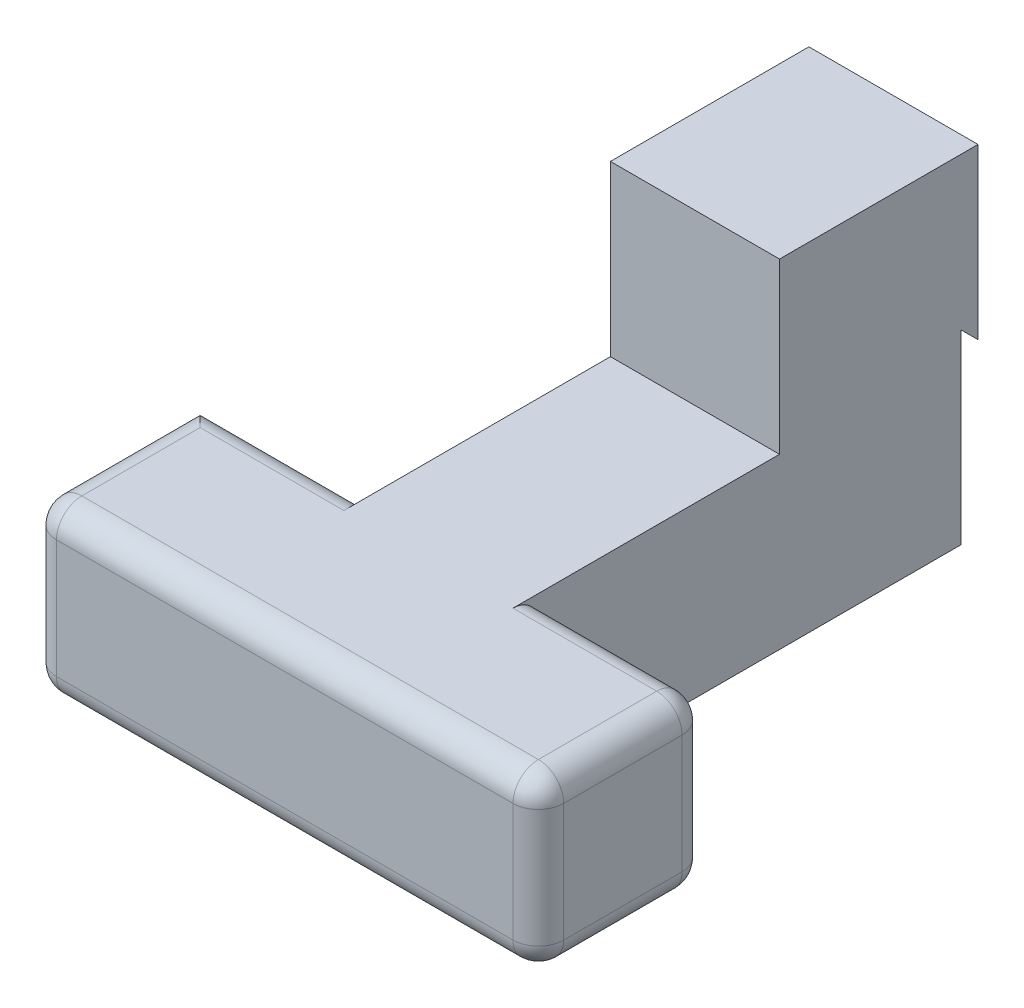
ISO-10303-21;
HEADER;
FILE_DESCRIPTION(('STEP AP214'),'2;1');
FILE_NAME('part.step','',(''),(''),'','','');
FILE_SCHEMA(('AUTOMOTIVE_DESIGN { 1 0 10303 214 1 1 1 1 }'));
ENDSEC;
DATA;
#1=APPLICATION_CONTEXT('core data for automotive mechanical design processes');
#2=APPLICATION_PROTOCOL_DEFINITION('international standard','automotive_design',2000,#1);
#3=PRODUCT_CONTEXT('',#1,'mechanical');
#4=PRODUCT('Part','Part','',(#3));
#5=PRODUCT_RELATED_PRODUCT_CATEGORY('part','',(#4));
#6=PRODUCT_DEFINITION_FORMATION('','',#4);
#7=PRODUCT_DEFINITION_CONTEXT('part definition',#1,'design');
#8=PRODUCT_DEFINITION('design','',#6,#7);
#9=PRODUCT_DEFINITION_SHAPE('','',#8);
#10=(LENGTH_UNIT() NAMED_UNIT(*) SI_UNIT(.MILLI.,.METRE.));
#11=(NAMED_UNIT(*) PLANE_ANGLE_UNIT() SI_UNIT($,.RADIAN.));
#12=(NAMED_UNIT(*) SI_UNIT($,.STERADIAN.) SOLID_ANGLE_UNIT());
#13=UNCERTAINTY_MEASURE_WITH_UNIT(LENGTH_MEASURE(1.E-05),#10,'distance_accuracy_value','');
#14=(GEOMETRIC_REPRESENTATION_CONTEXT(3) GLOBAL_UNCERTAINTY_ASSIGNED_CONTEXT((#13)) GLOBAL_UNIT_ASSIGNED_CONTEXT((#10,
#11,#12)) REPRESENTATION_CONTEXT('',''));
#15=CARTESIAN_POINT('',(0.,0.,0.));
#16=DIRECTION('',(0.,0.,1.));
#17=DIRECTION('',(1.,0.,0.));
#18=AXIS2_PLACEMENT_3D('',#15,#16,#17);
#19=CARTESIAN_POINT('',(10.,10.,25.));
#20=DIRECTION('',(-1.,0.,0.));
#21=DIRECTION('',(0.,0.,1.));
#22=AXIS2_PLACEMENT_3D('',#19,#20,#21);
#23=PLANE('',#22);
#24=DIRECTION('',(0.,0.707106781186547,0.707106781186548));
#25=VECTOR('',#24,1.);
#26=CARTESIAN_POINT('',(10.,12.,-25.));
#27=LINE('',#26,#25);
#28=CARTESIAN_POINT('',(10.,10.,-27.));
#29=VERTEX_POINT('',#28);
#30=CARTESIAN_POINT('',(10.,12.,-25.));
#31=VERTEX_POINT('',#30);
#32=EDGE_CURVE('E199',#29,#31,#27,.T.);
#33=ORIENTED_EDGE('',*,*,#32,.F.);
#34=DIRECTION('',(0.,-1.,0.));
#35=VECTOR('',#34,1.);
#36=CARTESIAN_POINT('',(10.,30.,-27.));
#37=LINE('',#36,#35);
#38=CARTESIAN_POINT('',(10.,30.,-27.));
#39=VERTEX_POINT('',#38);
#40=EDGE_CURVE('E234',#39,#29,#37,.T.);
#41=ORIENTED_EDGE('',*,*,#40,.F.);
#42=DIRECTION('',(0.,0.,-1.));
#43=VECTOR('',#42,1.);
#44=CARTESIAN_POINT('',(10.,30.,-3.52397749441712));
#45=LINE('',#44,#43);
#46=CARTESIAN_POINT('',(10.,30.,-3.52397749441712));
#47=VERTEX_POINT('',#46);
#48=EDGE_CURVE('E211',#47,#39,#45,.T.);
#49=ORIENTED_EDGE('',*,*,#48,.F.);
#50=DIRECTION('',(0.,-1.,0.));
#51=VECTOR('',#50,1.);
#52=CARTESIAN_POINT('',(10.,30.,-3.52397749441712));
#53=LINE('',#52,#51);
#54=CARTESIAN_POINT('',(10.,10.,-3.52397749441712));
#55=VERTEX_POINT('',#54);
#56=EDGE_CURVE('E222',#47,#55,#53,.T.);
#57=ORIENTED_EDGE('',*,*,#56,.T.);
#58=DIRECTION('',(0.,0.,-1.));
#59=VECTOR('',#58,1.);
#60=CARTESIAN_POINT('',(10.,10.,25.));
#61=LINE('',#60,#59);
#62=CARTESIAN_POINT('',(10.,10.,28.));
#63=VERTEX_POINT('',#62);
#64=EDGE_CURVE('E191',#63,#55,#61,.T.);
#65=ORIENTED_EDGE('',*,*,#64,.F.);
#66=CARTESIAN_POINT('',(10.,7.,28.));
#67=DIRECTION('',(-1.,0.,0.));
#68=DIRECTION('',(0.,0.,1.));
#69=AXIS2_PLACEMENT_3D('',#66,#67,#68);
#70=CIRCLE('',#69,3.);
#71=CARTESIAN_POINT('',(10.,7.,25.));
#72=VERTEX_POINT('',#71);
#73=EDGE_CURVE('E48',#63,#72,#70,.T.);
#74=ORIENTED_EDGE('',*,*,#73,.T.);
#75=DIRECTION('',(0.,-1.,0.));
#76=VECTOR('',#75,1.);
#77=CARTESIAN_POINT('',(10.,10.,25.));
#78=LINE('',#77,#76);
#79=CARTESIAN_POINT('',(10.,-7.,25.));
#80=VERTEX_POINT('',#79);
#81=EDGE_CURVE('E251',#72,#80,#78,.T.);
#82=ORIENTED_EDGE('',*,*,#81,.T.);
#83=CARTESIAN_POINT('',(10.,-7.,28.));
#84=DIRECTION('',(-1.,0.,0.));
#85=DIRECTION('',(0.,0.,1.));
#86=AXIS2_PLACEMENT_3D('',#83,#84,#85);
#87=CIRCLE('',#86,3.);
#88=CARTESIAN_POINT('',(10.,-10.,28.));
#89=VERTEX_POINT('',#88);
#90=EDGE_CURVE('E316',#80,#89,#87,.T.);
#91=ORIENTED_EDGE('',*,*,#90,.T.);
#92=DIRECTION('',(0.,0.,-1.));
#93=VECTOR('',#92,1.);
#94=CARTESIAN_POINT('',(10.,-10.,25.));
#95=LINE('',#94,#93);
#96=CARTESIAN_POINT('',(10.,-10.,-25.));
#97=VERTEX_POINT('',#96);
#98=EDGE_CURVE('E246',#89,#97,#95,.T.);
#99=ORIENTED_EDGE('',*,*,#98,.T.);
#100=DIRECTION('',(0.,-1.,0.));
#101=VECTOR('',#100,1.);
#102=CARTESIAN_POINT('',(10.,10.,-25.));
#103=LINE('',#102,#101);
#104=EDGE_CURVE('E57',#31,#97,#103,.T.);
#105=ORIENTED_EDGE('',*,*,#104,.F.);
#106=EDGE_LOOP('',(#33,#41,#49,#57,#65,#74,#82,#91,#99,#105));
#107=FACE_BOUND('',#106,.T.);
#108=ADVANCED_FACE('F39',(#107),#23,.F.);
#109=CARTESIAN_POINT('',(-10.,10.,25.));
#110=DIRECTION('',(1.,0.,0.));
#111=DIRECTION('',(0.,0.,-1.));
#112=AXIS2_PLACEMENT_3D('',#109,#110,#111);
#113=PLANE('',#112);
#114=DIRECTION('',(0.,-1.,0.));
#115=VECTOR('',#114,1.);
#116=CARTESIAN_POINT('',(-10.,30.,-27.));
#117=LINE('',#116,#115);
#118=CARTESIAN_POINT('',(-10.,30.,-27.));
#119=VERTEX_POINT('',#118);
#120=CARTESIAN_POINT('',(-10.,10.,-27.));
#121=VERTEX_POINT('',#120);
#122=EDGE_CURVE('E210',#119,#121,#117,.T.);
#123=ORIENTED_EDGE('',*,*,#122,.T.);
#124=DIRECTION('',(0.,0.707106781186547,0.707106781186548));
#125=VECTOR('',#124,1.);
#126=CARTESIAN_POINT('',(-10.,12.,-25.));
#127=LINE('',#126,#125);
#128=CARTESIAN_POINT('',(-10.,12.,-25.));
#129=VERTEX_POINT('',#128);
#130=EDGE_CURVE('E196',#121,#129,#127,.T.);
#131=ORIENTED_EDGE('',*,*,#130,.T.);
#132=DIRECTION('',(0.,-1.,0.));
#133=VECTOR('',#132,1.);
#134=CARTESIAN_POINT('',(-10.,10.,-25.));
#135=LINE('',#134,#133);
#136=CARTESIAN_POINT('',(-10.,-10.,-25.));
#137=VERTEX_POINT('',#136);
#138=EDGE_CURVE('E188',#129,#137,#135,.T.);
#139=ORIENTED_EDGE('',*,*,#138,.T.);
#140=DIRECTION('',(0.,0.,1.));
#141=VECTOR('',#140,1.);
#142=CARTESIAN_POINT('',(-10.,-10.,25.));
#143=LINE('',#142,#141);
#144=CARTESIAN_POINT('',(-10.,-10.,28.));
#145=VERTEX_POINT('',#144);
#146=EDGE_CURVE('E242',#137,#145,#143,.T.);
#147=ORIENTED_EDGE('',*,*,#146,.T.);
#148=CARTESIAN_POINT('',(-10.,-7.,28.));
#149=DIRECTION('',(1.,0.,0.));
#150=DIRECTION('',(0.,0.,-1.));
#151=AXIS2_PLACEMENT_3D('',#148,#149,#150);
#152=CIRCLE('',#151,3.);
#153=CARTESIAN_POINT('',(-10.,-7.,25.));
#154=VERTEX_POINT('',#153);
#155=EDGE_CURVE('E62',#145,#154,#152,.T.);
#156=ORIENTED_EDGE('',*,*,#155,.T.);
#157=DIRECTION('',(0.,-1.,0.));
#158=VECTOR('',#157,1.);
#159=CARTESIAN_POINT('',(-10.,10.,25.));
#160=LINE('',#159,#158);
#161=CARTESIAN_POINT('',(-10.,7.,25.));
#162=VERTEX_POINT('',#161);
#163=EDGE_CURVE('E258',#162,#154,#160,.T.);
#164=ORIENTED_EDGE('',*,*,#163,.F.);
#165=CARTESIAN_POINT('',(-10.,7.,28.));
#166=DIRECTION('',(1.,0.,0.));
#167=DIRECTION('',(0.,0.,-1.));
#168=AXIS2_PLACEMENT_3D('',#165,#166,#167);
#169=CIRCLE('',#168,3.);
#170=CARTESIAN_POINT('',(-10.,10.,28.));
#171=VERTEX_POINT('',#170);
#172=EDGE_CURVE('E11',#162,#171,#169,.T.);
#173=ORIENTED_EDGE('',*,*,#172,.T.);
#174=DIRECTION('',(0.,0.,1.));
#175=VECTOR('',#174,1.);
#176=CARTESIAN_POINT('',(-10.,10.,25.));
#177=LINE('',#176,#175);
#178=CARTESIAN_POINT('',(-10.,10.,-3.52397749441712));
#179=VERTEX_POINT('',#178);
#180=EDGE_CURVE('E244',#179,#171,#177,.T.);
#181=ORIENTED_EDGE('',*,*,#180,.F.);
#182=DIRECTION('',(0.,-1.,0.));
#183=VECTOR('',#182,1.);
#184=CARTESIAN_POINT('',(-10.,30.,-3.52397749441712));
#185=LINE('',#184,#183);
#186=CARTESIAN_POINT('',(-10.,30.,-3.52397749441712));
#187=VERTEX_POINT('',#186);
#188=EDGE_CURVE('E226',#187,#179,#185,.T.);
#189=ORIENTED_EDGE('',*,*,#188,.F.);
#190=DIRECTION('',(0.,0.,1.));
#191=VECTOR('',#190,1.);
#192=CARTESIAN_POINT('',(-10.,30.,-3.52397749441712));
#193=LINE('',#192,#191);
#194=EDGE_CURVE('E220',#119,#187,#193,.T.);
#195=ORIENTED_EDGE('',*,*,#194,.F.);
#196=EDGE_LOOP('',(#123,#131,#139,#147,#156,#164,#173,#181,#189,#195));
#197=FACE_BOUND('',#196,.T.);
#198=ADVANCED_FACE('F204',(#197),#113,.F.);
#199=CARTESIAN_POINT('',(10.,10.,-25.));
#200=DIRECTION('',(0.,0.,1.));
#201=DIRECTION('',(1.,0.,0.));
#202=AXIS2_PLACEMENT_3D('',#199,#200,#201);
#203=PLANE('',#202);
#204=CARTESIAN_POINT('',(0.,0.,-25.));
#205=DIRECTION('',(0.,0.,-1.));
#206=DIRECTION('',(-1.,0.,0.));
#207=AXIS2_PLACEMENT_3D('',#204,#205,#206);
#208=CIRCLE('',#207,5.);
#209=CARTESIAN_POINT('',(-5.,0.,-25.));
#210=VERTEX_POINT('',#209);
#211=EDGE_CURVE('E233',#210,#210,#208,.T.);
#212=ORIENTED_EDGE('',*,*,#211,.F.);
#213=EDGE_LOOP('',(#212));
#214=FACE_BOUND('',#213,.T.);
#215=DIRECTION('',(-1.,0.,0.));
#216=VECTOR('',#215,1.);
#217=CARTESIAN_POINT('',(10.,-10.,-25.));
#218=LINE('',#217,#216);
#219=EDGE_CURVE('E192',#97,#137,#218,.T.);
#220=ORIENTED_EDGE('',*,*,#219,.T.);
#221=ORIENTED_EDGE('',*,*,#138,.F.);
#222=DIRECTION('',(1.,0.,0.));
#223=VECTOR('',#222,1.);
#224=CARTESIAN_POINT('',(-10.,12.,-25.));
#225=LINE('',#224,#223);
#226=EDGE_CURVE('E187',#129,#31,#225,.T.);
#227=ORIENTED_EDGE('',*,*,#226,.T.);
#228=ORIENTED_EDGE('',*,*,#104,.T.);
#229=EDGE_LOOP('',(#220,#221,#227,#228));
#230=FACE_BOUND('',#229,.T.);
#231=ADVANCED_FACE('F186',(#214,#230),#203,.F.);
#232=CARTESIAN_POINT('',(0.,10.,0.));
#233=DIRECTION('',(0.,1.,0.));
#234=DIRECTION('',(0.,0.,1.));
#235=AXIS2_PLACEMENT_3D('',#232,#233,#234);
#236=PLANE('',#235);
#237=DIRECTION('',(-1.,0.,0.));
#238=VECTOR('',#237,1.);
#239=CARTESIAN_POINT('',(10.,10.,28.));
#240=LINE('',#239,#238);
#241=CARTESIAN_POINT('',(27.,10.,28.));
#242=VERTEX_POINT('',#241);
#243=EDGE_CURVE('E270',#242,#63,#240,.T.);
#244=ORIENTED_EDGE('',*,*,#243,.T.);
#245=ORIENTED_EDGE('',*,*,#64,.T.);
#246=DIRECTION('',(1.,0.,0.));
#247=VECTOR('',#246,1.);
#248=CARTESIAN_POINT('',(-10.,10.,-3.52397749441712));
#249=LINE('',#248,#247);
#250=EDGE_CURVE('E214',#179,#55,#249,.T.);
#251=ORIENTED_EDGE('',*,*,#250,.F.);
#252=ORIENTED_EDGE('',*,*,#180,.T.);
#253=DIRECTION('',(-1.,0.,0.));
#254=VECTOR('',#253,1.);
#255=CARTESIAN_POINT('',(-30.,10.,28.));
#256=LINE('',#255,#254);
#257=CARTESIAN_POINT('',(-27.,10.,28.));
#258=VERTEX_POINT('',#257);
#259=EDGE_CURVE('E256',#171,#258,#256,.T.);
#260=ORIENTED_EDGE('',*,*,#259,.T.);
#261=DIRECTION('',(0.,0.,1.));
#262=VECTOR('',#261,1.);
#263=CARTESIAN_POINT('',(-27.,10.,45.));
#264=LINE('',#263,#262);
#265=CARTESIAN_POINT('',(-27.,10.,42.));
#266=VERTEX_POINT('',#265);
#267=EDGE_CURVE('E257',#258,#266,#264,.T.);
#268=ORIENTED_EDGE('',*,*,#267,.T.);
#269=DIRECTION('',(1.,0.,0.));
#270=VECTOR('',#269,1.);
#271=CARTESIAN_POINT('',(30.,10.,42.));
#272=LINE('',#271,#270);
#273=CARTESIAN_POINT('',(27.,10.,42.));
#274=VERTEX_POINT('',#273);
#275=EDGE_CURVE('E263',#266,#274,#272,.T.);
#276=ORIENTED_EDGE('',*,*,#275,.T.);
#277=DIRECTION('',(0.,0.,-1.));
#278=VECTOR('',#277,1.);
#279=CARTESIAN_POINT('',(27.,10.,25.));
#280=LINE('',#279,#278);
#281=EDGE_CURVE('E264',#274,#242,#280,.T.);
#282=ORIENTED_EDGE('',*,*,#281,.T.);
#283=EDGE_LOOP('',(#244,#245,#251,#252,#260,#268,#276,#282));
#284=FACE_BOUND('',#283,.T.);
#285=ADVANCED_FACE('F444',(#284),#236,.T.);
#286=CARTESIAN_POINT('',(0.,-10.,0.));
#287=DIRECTION('',(0.,1.,0.));
#288=DIRECTION('',(0.,0.,1.));
#289=AXIS2_PLACEMENT_3D('',#286,#287,#288);
#290=PLANE('',#289);
#291=DIRECTION('',(-1.,0.,0.));
#292=VECTOR('',#291,1.);
#293=CARTESIAN_POINT('',(0.,-10.,28.));
#294=LINE('',#293,#292);
#295=CARTESIAN_POINT('',(-27.,-10.,28.));
#296=VERTEX_POINT('',#295);
#297=EDGE_CURVE('E306',#296,#145,#294,.F.);
#298=ORIENTED_EDGE('',*,*,#297,.T.);
#299=ORIENTED_EDGE('',*,*,#146,.F.);
#300=ORIENTED_EDGE('',*,*,#219,.F.);
#301=ORIENTED_EDGE('',*,*,#98,.F.);
#302=DIRECTION('',(-1.,0.,0.));
#303=VECTOR('',#302,1.);
#304=CARTESIAN_POINT('',(0.,-10.,28.));
#305=LINE('',#304,#303);
#306=CARTESIAN_POINT('',(27.,-10.,28.));
#307=VERTEX_POINT('',#306);
#308=EDGE_CURVE('E304',#89,#307,#305,.F.);
#309=ORIENTED_EDGE('',*,*,#308,.T.);
#310=DIRECTION('',(0.,0.,-1.));
#311=VECTOR('',#310,1.);
#312=CARTESIAN_POINT('',(27.,-10.,0.));
#313=LINE('',#312,#311);
#314=CARTESIAN_POINT('',(27.,-10.,42.));
#315=VERTEX_POINT('',#314);
#316=EDGE_CURVE('E299',#307,#315,#313,.F.);
#317=ORIENTED_EDGE('',*,*,#316,.T.);
#318=DIRECTION('',(1.,0.,0.));
#319=VECTOR('',#318,1.);
#320=CARTESIAN_POINT('',(0.,-10.,42.));
#321=LINE('',#320,#319);
#322=CARTESIAN_POINT('',(-27.,-10.,42.));
#323=VERTEX_POINT('',#322);
#324=EDGE_CURVE('E301',#315,#323,#321,.F.);
#325=ORIENTED_EDGE('',*,*,#324,.T.);
#326=DIRECTION('',(0.,0.,1.));
#327=VECTOR('',#326,1.);
#328=CARTESIAN_POINT('',(-27.,-10.,0.));
#329=LINE('',#328,#327);
#330=EDGE_CURVE('E308',#323,#296,#329,.F.);
#331=ORIENTED_EDGE('',*,*,#330,.T.);
#332=EDGE_LOOP('',(#298,#299,#300,#301,#309,#317,#325,#331));
#333=FACE_BOUND('',#332,.T.);
#334=ADVANCED_FACE('F407',(#333),#290,.F.);
#335=CARTESIAN_POINT('',(30.,10.,25.));
#336=DIRECTION('',(0.,0.,1.));
#337=DIRECTION('',(1.,0.,0.));
#338=AXIS2_PLACEMENT_3D('',#335,#336,#337);
#339=PLANE('',#338);
#340=ORIENTED_EDGE('',*,*,#163,.T.);
#341=DIRECTION('',(-1.,0.,0.));
#342=VECTOR('',#341,1.);
#343=CARTESIAN_POINT('',(30.,-7.,25.));
#344=LINE('',#343,#342);
#345=CARTESIAN_POINT('',(-30.,-7.,25.));
#346=VERTEX_POINT('',#345);
#347=EDGE_CURVE('E311',#154,#346,#344,.T.);
#348=ORIENTED_EDGE('',*,*,#347,.T.);
#349=DIRECTION('',(0.,-1.,0.));
#350=VECTOR('',#349,1.);
#351=CARTESIAN_POINT('',(-30.,10.,25.));
#352=LINE('',#351,#350);
#353=CARTESIAN_POINT('',(-30.,7.,25.));
#354=VERTEX_POINT('',#353);
#355=EDGE_CURVE('E239',#354,#346,#352,.T.);
#356=ORIENTED_EDGE('',*,*,#355,.F.);
#357=DIRECTION('',(-1.,0.,0.));
#358=VECTOR('',#357,1.);
#359=CARTESIAN_POINT('',(-10.,7.,25.));
#360=LINE('',#359,#358);
#361=EDGE_CURVE('E313',#354,#162,#360,.F.);
#362=ORIENTED_EDGE('',*,*,#361,.T.);
#363=EDGE_LOOP('',(#340,#348,#356,#362));
#364=FACE_BOUND('',#363,.T.);
#365=ADVANCED_FACE('F419',(#364),#339,.F.);
#366=CARTESIAN_POINT('',(-30.,10.,45.));
#367=DIRECTION('',(1.,0.,0.));
#368=DIRECTION('',(0.,0.,-1.));
#369=AXIS2_PLACEMENT_3D('',#366,#367,#368);
#370=PLANE('',#369);
#371=DIRECTION('',(0.,-1.,0.));
#372=VECTOR('',#371,1.);
#373=CARTESIAN_POINT('',(-30.,10.,42.));
#374=LINE('',#373,#372);
#375=CARTESIAN_POINT('',(-30.,-7.,42.));
#376=VERTEX_POINT('',#375);
#377=CARTESIAN_POINT('',(-30.,7.,42.));
#378=VERTEX_POINT('',#377);
#379=EDGE_CURVE('E269',#376,#378,#374,.F.);
#380=ORIENTED_EDGE('',*,*,#379,.T.);
#381=DIRECTION('',(0.,0.,1.));
#382=VECTOR('',#381,1.);
#383=CARTESIAN_POINT('',(-30.,7.,25.));
#384=LINE('',#383,#382);
#385=EDGE_CURVE('E273',#378,#354,#384,.F.);
#386=ORIENTED_EDGE('',*,*,#385,.T.);
#387=ORIENTED_EDGE('',*,*,#355,.T.);
#388=DIRECTION('',(0.,0.,1.));
#389=VECTOR('',#388,1.);
#390=CARTESIAN_POINT('',(-30.,-7.,45.));
#391=LINE('',#390,#389);
#392=EDGE_CURVE('E275',#346,#376,#391,.T.);
#393=ORIENTED_EDGE('',*,*,#392,.T.);
#394=EDGE_LOOP('',(#380,#386,#387,#393));
#395=FACE_BOUND('',#394,.T.);
#396=ADVANCED_FACE('F421',(#395),#370,.F.);
#397=CARTESIAN_POINT('',(30.,10.,45.));
#398=DIRECTION('',(0.,0.,-1.));
#399=DIRECTION('',(-1.,0.,0.));
#400=AXIS2_PLACEMENT_3D('',#397,#398,#399);
#401=PLANE('',#400);
#402=DIRECTION('',(0.,-1.,0.));
#403=VECTOR('',#402,1.);
#404=CARTESIAN_POINT('',(-27.,10.,45.));
#405=LINE('',#404,#403);
#406=CARTESIAN_POINT('',(-27.,7.,45.));
#407=VERTEX_POINT('',#406);
#408=CARTESIAN_POINT('',(-27.,-7.,45.));
#409=VERTEX_POINT('',#408);
#410=EDGE_CURVE('E291',#407,#409,#405,.T.);
#411=ORIENTED_EDGE('',*,*,#410,.T.);
#412=DIRECTION('',(1.,0.,0.));
#413=VECTOR('',#412,1.);
#414=CARTESIAN_POINT('',(30.,-7.,45.));
#415=LINE('',#414,#413);
#416=CARTESIAN_POINT('',(27.,-7.,45.));
#417=VERTEX_POINT('',#416);
#418=EDGE_CURVE('E300',#409,#417,#415,.T.);
#419=ORIENTED_EDGE('',*,*,#418,.T.);
#420=DIRECTION('',(0.,-1.,0.));
#421=VECTOR('',#420,1.);
#422=CARTESIAN_POINT('',(27.,10.,45.));
#423=LINE('',#422,#421);
#424=CARTESIAN_POINT('',(27.,7.,45.));
#425=VERTEX_POINT('',#424);
#426=EDGE_CURVE('E293',#417,#425,#423,.F.);
#427=ORIENTED_EDGE('',*,*,#426,.T.);
#428=DIRECTION('',(1.,0.,0.));
#429=VECTOR('',#428,1.);
#430=CARTESIAN_POINT('',(-30.,7.,45.));
#431=LINE('',#430,#429);
#432=EDGE_CURVE('E292',#425,#407,#431,.F.);
#433=ORIENTED_EDGE('',*,*,#432,.T.);
#434=EDGE_LOOP('',(#411,#419,#427,#433));
#435=FACE_BOUND('',#434,.T.);
#436=ADVANCED_FACE('F697',(#435),#401,.F.);
#437=CARTESIAN_POINT('',(30.,10.,45.));
#438=DIRECTION('',(-1.,0.,0.));
#439=DIRECTION('',(0.,0.,1.));
#440=AXIS2_PLACEMENT_3D('',#437,#438,#439);
#441=PLANE('',#440);
#442=DIRECTION('',(0.,-1.,0.));
#443=VECTOR('',#442,1.);
#444=CARTESIAN_POINT('',(30.,10.,42.));
#445=LINE('',#444,#443);
#446=CARTESIAN_POINT('',(30.,7.,42.));
#447=VERTEX_POINT('',#446);
#448=CARTESIAN_POINT('',(30.,-7.,42.));
#449=VERTEX_POINT('',#448);
#450=EDGE_CURVE('E282',#447,#449,#445,.T.);
#451=ORIENTED_EDGE('',*,*,#450,.T.);
#452=DIRECTION('',(0.,0.,-1.));
#453=VECTOR('',#452,1.);
#454=CARTESIAN_POINT('',(30.,-7.,45.));
#455=LINE('',#454,#453);
#456=CARTESIAN_POINT('',(30.,-7.,28.));
#457=VERTEX_POINT('',#456);
#458=EDGE_CURVE('E286',#449,#457,#455,.T.);
#459=ORIENTED_EDGE('',*,*,#458,.T.);
#460=DIRECTION('',(0.,-1.,0.));
#461=VECTOR('',#460,1.);
#462=CARTESIAN_POINT('',(30.,10.,28.));
#463=LINE('',#462,#461);
#464=CARTESIAN_POINT('',(30.,7.,28.));
#465=VERTEX_POINT('',#464);
#466=EDGE_CURVE('E287',#457,#465,#463,.F.);
#467=ORIENTED_EDGE('',*,*,#466,.T.);
#468=DIRECTION('',(0.,0.,-1.));
#469=VECTOR('',#468,1.);
#470=CARTESIAN_POINT('',(30.,7.,45.));
#471=LINE('',#470,#469);
#472=EDGE_CURVE('E285',#465,#447,#471,.F.);
#473=ORIENTED_EDGE('',*,*,#472,.T.);
#474=EDGE_LOOP('',(#451,#459,#467,#473));
#475=FACE_BOUND('',#474,.T.);
#476=ADVANCED_FACE('F402',(#475),#441,.F.);
#477=DIRECTION('',(0.,-1.,0.));
#478=VECTOR('',#477,1.);
#479=CARTESIAN_POINT('',(27.,10.,25.));
#480=LINE('',#479,#478);
#481=CARTESIAN_POINT('',(27.,7.,25.));
#482=VERTEX_POINT('',#481);
#483=CARTESIAN_POINT('',(27.,-7.,25.));
#484=VERTEX_POINT('',#483);
#485=EDGE_CURVE('E279',#482,#484,#480,.T.);
#486=ORIENTED_EDGE('',*,*,#485,.T.);
#487=DIRECTION('',(-1.,0.,0.));
#488=VECTOR('',#487,1.);
#489=CARTESIAN_POINT('',(30.,-7.,25.));
#490=LINE('',#489,#488);
#491=EDGE_CURVE('E278',#484,#80,#490,.T.);
#492=ORIENTED_EDGE('',*,*,#491,.T.);
#493=ORIENTED_EDGE('',*,*,#81,.F.);
#494=DIRECTION('',(-1.,0.,0.));
#495=VECTOR('',#494,1.);
#496=CARTESIAN_POINT('',(30.,7.,25.));
#497=LINE('',#496,#495);
#498=EDGE_CURVE('E277',#72,#482,#497,.F.);
#499=ORIENTED_EDGE('',*,*,#498,.T.);
#500=EDGE_LOOP('',(#486,#492,#493,#499));
#501=FACE_BOUND('',#500,.T.);
#502=ADVANCED_FACE('F386',(#501),#339,.F.);
#503=CARTESIAN_POINT('',(0.,0.,-5.));
#504=DIRECTION('',(0.,0.,-1.));
#505=DIRECTION('',(-1.,0.,0.));
#506=AXIS2_PLACEMENT_3D('',#503,#504,#505);
#507=CYLINDRICAL_SURFACE('',#506,5.);
#508=CARTESIAN_POINT('',(0.,0.,-5.));
#509=DIRECTION('',(0.,0.,-1.));
#510=DIRECTION('',(-1.,0.,0.));
#511=AXIS2_PLACEMENT_3D('',#508,#509,#510);
#512=CIRCLE('',#511,5.);
#513=CARTESIAN_POINT('',(-5.,0.,-5.));
#514=VERTEX_POINT('',#513);
#515=EDGE_CURVE('E237',#514,#514,#512,.T.);
#516=ORIENTED_EDGE('',*,*,#515,.F.);
#517=EDGE_LOOP('',(#516));
#518=FACE_BOUND('',#517,.T.);
#519=ORIENTED_EDGE('',*,*,#211,.T.);
#520=EDGE_LOOP('',(#519));
#521=FACE_BOUND('',#520,.T.);
#522=ADVANCED_FACE('F468',(#518,#521),#507,.F.);
#523=CARTESIAN_POINT('',(0.,0.,-5.));
#524=DIRECTION('',(0.,0.,-1.));
#525=DIRECTION('',(-1.,0.,0.));
#526=AXIS2_PLACEMENT_3D('',#523,#524,#525);
#527=PLANE('',#526);
#528=ORIENTED_EDGE('',*,*,#515,.T.);
#529=EDGE_LOOP('',(#528));
#530=FACE_BOUND('',#529,.T.);
#531=ADVANCED_FACE('F463',(#530),#527,.T.);
#532=CARTESIAN_POINT('',(-10.,30.,-27.));
#533=DIRECTION('',(0.,0.,1.));
#534=DIRECTION('',(1.,0.,0.));
#535=AXIS2_PLACEMENT_3D('',#532,#533,#534);
#536=PLANE('',#535);
#537=DIRECTION('',(-1.,0.,0.));
#538=VECTOR('',#537,1.);
#539=CARTESIAN_POINT('',(-10.,10.,-27.));
#540=LINE('',#539,#538);
#541=EDGE_CURVE('E225',#29,#121,#540,.T.);
#542=ORIENTED_EDGE('',*,*,#541,.T.);
#543=ORIENTED_EDGE('',*,*,#122,.F.);
#544=DIRECTION('',(-1.,0.,0.));
#545=VECTOR('',#544,1.);
#546=CARTESIAN_POINT('',(-10.,30.,-27.));
#547=LINE('',#546,#545);
#548=EDGE_CURVE('E212',#39,#119,#547,.T.);
#549=ORIENTED_EDGE('',*,*,#548,.F.);
#550=ORIENTED_EDGE('',*,*,#40,.T.);
#551=EDGE_LOOP('',(#542,#543,#549,#550));
#552=FACE_BOUND('',#551,.T.);
#553=ADVANCED_FACE('F459',(#552),#536,.F.);
#554=CARTESIAN_POINT('',(-10.,30.,-3.52397749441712));
#555=DIRECTION('',(0.,0.,-1.));
#556=DIRECTION('',(-1.,0.,0.));
#557=AXIS2_PLACEMENT_3D('',#554,#555,#556);
#558=PLANE('',#557);
#559=ORIENTED_EDGE('',*,*,#250,.T.);
#560=ORIENTED_EDGE('',*,*,#56,.F.);
#561=DIRECTION('',(1.,0.,0.));
#562=VECTOR('',#561,1.);
#563=CARTESIAN_POINT('',(-10.,30.,-3.52397749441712));
#564=LINE('',#563,#562);
#565=EDGE_CURVE('E218',#187,#47,#564,.T.);
#566=ORIENTED_EDGE('',*,*,#565,.F.);
#567=ORIENTED_EDGE('',*,*,#188,.T.);
#568=EDGE_LOOP('',(#559,#560,#566,#567));
#569=FACE_BOUND('',#568,.T.);
#570=ADVANCED_FACE('F454',(#569),#558,.F.);
#571=CARTESIAN_POINT('',(0.,30.,0.));
#572=DIRECTION('',(0.,-1.,0.));
#573=DIRECTION('',(0.,0.,-1.));
#574=AXIS2_PLACEMENT_3D('',#571,#572,#573);
#575=PLANE('',#574);
#576=ORIENTED_EDGE('',*,*,#48,.T.);
#577=ORIENTED_EDGE('',*,*,#548,.T.);
#578=ORIENTED_EDGE('',*,*,#194,.T.);
#579=ORIENTED_EDGE('',*,*,#565,.T.);
#580=EDGE_LOOP('',(#576,#577,#578,#579));
#581=FACE_BOUND('',#580,.T.);
#582=ADVANCED_FACE('F457',(#581),#575,.F.);
#583=CARTESIAN_POINT('',(30.,-7.,28.));
#584=DIRECTION('',(-1.,0.,0.));
#585=DIRECTION('',(0.,0.,1.));
#586=AXIS2_PLACEMENT_3D('',#583,#584,#585);
#587=CYLINDRICAL_SURFACE('',#586,3.);
#588=CARTESIAN_POINT('',(27.,-7.,28.));
#589=DIRECTION('',(1.,0.,0.));
#590=DIRECTION('',(0.,0.,-1.));
#591=AXIS2_PLACEMENT_3D('',#588,#589,#590);
#592=CIRCLE('',#591,3.);
#593=EDGE_CURVE('E43',#307,#484,#592,.T.);
#594=ORIENTED_EDGE('',*,*,#593,.F.);
#595=ORIENTED_EDGE('',*,*,#308,.F.);
#596=ORIENTED_EDGE('',*,*,#90,.F.);
#597=ORIENTED_EDGE('',*,*,#491,.F.);
#598=EDGE_LOOP('',(#594,#595,#596,#597));
#599=FACE_BOUND('',#598,.T.);
#600=ADVANCED_FACE('F41',(#599),#587,.T.);
#601=CARTESIAN_POINT('',(27.,-7.,28.));
#602=DIRECTION('',(0.,0.,-1.));
#603=DIRECTION('',(0.,1.,0.));
#604=AXIS2_PLACEMENT_3D('',#601,#602,#603);
#605=SPHERICAL_SURFACE('',#604,3.);
#606=CARTESIAN_POINT('',(27.,-7.,28.));
#607=DIRECTION('',(0.,0.,-1.));
#608=DIRECTION('',(-1.,0.,0.));
#609=AXIS2_PLACEMENT_3D('',#606,#607,#608);
#610=CIRCLE('',#609,3.);
#611=EDGE_CURVE('E369',#307,#457,#610,.F.);
#612=ORIENTED_EDGE('',*,*,#611,.F.);
#613=ORIENTED_EDGE('',*,*,#593,.T.);
#614=CARTESIAN_POINT('',(27.,-7.,28.));
#615=DIRECTION('',(0.,-1.,0.));
#616=DIRECTION('',(0.,0.,-1.));
#617=AXIS2_PLACEMENT_3D('',#614,#615,#616);
#618=CIRCLE('',#617,3.);
#619=EDGE_CURVE('E371',#457,#484,#618,.F.);
#620=ORIENTED_EDGE('',*,*,#619,.F.);
#621=EDGE_LOOP('',(#612,#613,#620));
#622=FACE_BOUND('',#621,.T.);
#623=ADVANCED_FACE('F381',(#622),#605,.T.);
#624=CARTESIAN_POINT('',(0.,7.,28.));
#625=DIRECTION('',(1.,0.,0.));
#626=DIRECTION('',(0.,0.,-1.));
#627=AXIS2_PLACEMENT_3D('',#624,#625,#626);
#628=CYLINDRICAL_SURFACE('',#627,3.);
#629=ORIENTED_EDGE('',*,*,#73,.F.);
#630=ORIENTED_EDGE('',*,*,#243,.F.);
#631=CARTESIAN_POINT('',(27.,7.,28.));
#632=DIRECTION('',(1.,0.,0.));
#633=DIRECTION('',(0.,0.,-1.));
#634=AXIS2_PLACEMENT_3D('',#631,#632,#633);
#635=CIRCLE('',#634,3.);
#636=EDGE_CURVE('E368',#482,#242,#635,.T.);
#637=ORIENTED_EDGE('',*,*,#636,.F.);
#638=ORIENTED_EDGE('',*,*,#498,.F.);
#639=EDGE_LOOP('',(#629,#630,#637,#638));
#640=FACE_BOUND('',#639,.T.);
#641=ADVANCED_FACE('F392',(#640),#628,.T.);
#642=CARTESIAN_POINT('',(27.,10.,28.));
#643=DIRECTION('',(0.,-1.,0.));
#644=DIRECTION('',(0.,0.,-1.));
#645=AXIS2_PLACEMENT_3D('',#642,#643,#644);
#646=CYLINDRICAL_SURFACE('',#645,3.);
#647=ORIENTED_EDGE('',*,*,#619,.T.);
#648=ORIENTED_EDGE('',*,*,#485,.F.);
#649=CARTESIAN_POINT('',(27.,7.,28.));
#650=DIRECTION('',(0.,1.,0.));
#651=DIRECTION('',(0.,0.,1.));
#652=AXIS2_PLACEMENT_3D('',#649,#650,#651);
#653=CIRCLE('',#652,3.);
#654=EDGE_CURVE('E361',#465,#482,#653,.T.);
#655=ORIENTED_EDGE('',*,*,#654,.F.);
#656=ORIENTED_EDGE('',*,*,#466,.F.);
#657=EDGE_LOOP('',(#647,#648,#655,#656));
#658=FACE_BOUND('',#657,.T.);
#659=ADVANCED_FACE('F399',(#658),#646,.T.);
#660=CARTESIAN_POINT('',(27.,-7.,45.));
#661=DIRECTION('',(0.,0.,-1.));
#662=DIRECTION('',(-1.,0.,0.));
#663=AXIS2_PLACEMENT_3D('',#660,#661,#662);
#664=CYLINDRICAL_SURFACE('',#663,3.);
#665=ORIENTED_EDGE('',*,*,#611,.T.);
#666=ORIENTED_EDGE('',*,*,#458,.F.);
#667=CARTESIAN_POINT('',(27.,-7.,42.));
#668=DIRECTION('',(0.,0.,1.));
#669=DIRECTION('',(1.,0.,0.));
#670=AXIS2_PLACEMENT_3D('',#667,#668,#669);
#671=CIRCLE('',#670,3.);
#672=EDGE_CURVE('E358',#315,#449,#671,.T.);
#673=ORIENTED_EDGE('',*,*,#672,.F.);
#674=ORIENTED_EDGE('',*,*,#316,.F.);
#675=EDGE_LOOP('',(#665,#666,#673,#674));
#676=FACE_BOUND('',#675,.T.);
#677=ADVANCED_FACE('F408',(#676),#664,.T.);
#678=CARTESIAN_POINT('',(27.,7.,28.));
#679=DIRECTION('',(0.,0.,-1.));
#680=DIRECTION('',(-1.,0.,0.));
#681=AXIS2_PLACEMENT_3D('',#678,#679,#680);
#682=SPHERICAL_SURFACE('',#681,3.);
#683=ORIENTED_EDGE('',*,*,#654,.T.);
#684=ORIENTED_EDGE('',*,*,#636,.T.);
#685=CARTESIAN_POINT('',(27.,7.,28.));
#686=DIRECTION('',(0.,0.,-1.));
#687=DIRECTION('',(-1.,0.,0.));
#688=AXIS2_PLACEMENT_3D('',#685,#686,#687);
#689=CIRCLE('',#688,3.);
#690=EDGE_CURVE('E359',#465,#242,#689,.F.);
#691=ORIENTED_EDGE('',*,*,#690,.F.);
#692=EDGE_LOOP('',(#683,#684,#691));
#693=FACE_BOUND('',#692,.T.);
#694=ADVANCED_FACE('F525',(#693),#682,.T.);
#695=CARTESIAN_POINT('',(27.,-7.,42.));
#696=DIRECTION('',(1.,0.,0.));
#697=DIRECTION('',(0.,1.,0.));
#698=AXIS2_PLACEMENT_3D('',#695,#696,#697);
#699=SPHERICAL_SURFACE('',#698,3.);
#700=CARTESIAN_POINT('',(27.,-7.,42.));
#701=DIRECTION('',(1.,0.,0.));
#702=DIRECTION('',(0.,0.,-1.));
#703=AXIS2_PLACEMENT_3D('',#700,#701,#702);
#704=CIRCLE('',#703,3.);
#705=EDGE_CURVE('E353',#315,#417,#704,.F.);
#706=ORIENTED_EDGE('',*,*,#705,.F.);
#707=ORIENTED_EDGE('',*,*,#672,.T.);
#708=CARTESIAN_POINT('',(27.,-7.,42.));
#709=DIRECTION('',(0.,-1.,0.));
#710=DIRECTION('',(0.,0.,-1.));
#711=AXIS2_PLACEMENT_3D('',#708,#709,#710);
#712=CIRCLE('',#711,3.);
#713=EDGE_CURVE('E352',#417,#449,#712,.F.);
#714=ORIENTED_EDGE('',*,*,#713,.F.);
#715=EDGE_LOOP('',(#706,#707,#714));
#716=FACE_BOUND('',#715,.T.);
#717=ADVANCED_FACE('F519',(#716),#699,.T.);
#718=CARTESIAN_POINT('',(30.,-7.,28.));
#719=DIRECTION('',(-1.,0.,0.));
#720=DIRECTION('',(0.,0.,1.));
#721=AXIS2_PLACEMENT_3D('',#718,#719,#720);
#722=CYLINDRICAL_SURFACE('',#721,3.);
#723=ORIENTED_EDGE('',*,*,#155,.F.);
#724=ORIENTED_EDGE('',*,*,#297,.F.);
#725=CARTESIAN_POINT('',(-27.,-7.,28.));
#726=DIRECTION('',(-0.707106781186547,0.,0.707106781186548));
#727=DIRECTION('',(-0.707106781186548,0.,-0.707106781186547));
#728=AXIS2_PLACEMENT_3D('',#725,#726,#727);
#729=ELLIPSE('',#728,4.24264068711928,3.);
#730=EDGE_CURVE('E346',#346,#296,#729,.T.);
#731=ORIENTED_EDGE('',*,*,#730,.F.);
#732=ORIENTED_EDGE('',*,*,#347,.F.);
#733=EDGE_LOOP('',(#723,#724,#731,#732));
#734=FACE_BOUND('',#733,.T.);
#735=ADVANCED_FACE('F418',(#734),#722,.T.);
#736=CARTESIAN_POINT('',(27.,7.,0.));
#737=DIRECTION('',(0.,0.,1.));
#738=DIRECTION('',(1.,0.,0.));
#739=AXIS2_PLACEMENT_3D('',#736,#737,#738);
#740=CYLINDRICAL_SURFACE('',#739,3.);
#741=ORIENTED_EDGE('',*,*,#690,.T.);
#742=ORIENTED_EDGE('',*,*,#281,.F.);
#743=CARTESIAN_POINT('',(27.,7.,42.));
#744=DIRECTION('',(0.,0.,1.));
#745=DIRECTION('',(1.,0.,0.));
#746=AXIS2_PLACEMENT_3D('',#743,#744,#745);
#747=CIRCLE('',#746,3.);
#748=EDGE_CURVE('E343',#447,#274,#747,.T.);
#749=ORIENTED_EDGE('',*,*,#748,.F.);
#750=ORIENTED_EDGE('',*,*,#472,.F.);
#751=EDGE_LOOP('',(#741,#742,#749,#750));
#752=FACE_BOUND('',#751,.T.);
#753=ADVANCED_FACE('F511',(#752),#740,.T.);
#754=CARTESIAN_POINT('',(27.,10.,42.));
#755=DIRECTION('',(0.,-1.,0.));
#756=DIRECTION('',(0.,0.,-1.));
#757=AXIS2_PLACEMENT_3D('',#754,#755,#756);
#758=CYLINDRICAL_SURFACE('',#757,3.);
#759=ORIENTED_EDGE('',*,*,#713,.T.);
#760=ORIENTED_EDGE('',*,*,#450,.F.);
#761=CARTESIAN_POINT('',(27.,7.,42.));
#762=DIRECTION('',(0.,1.,0.));
#763=DIRECTION('',(0.,0.,1.));
#764=AXIS2_PLACEMENT_3D('',#761,#762,#763);
#765=CIRCLE('',#764,3.);
#766=EDGE_CURVE('E344',#425,#447,#765,.T.);
#767=ORIENTED_EDGE('',*,*,#766,.F.);
#768=ORIENTED_EDGE('',*,*,#426,.F.);
#769=EDGE_LOOP('',(#759,#760,#767,#768));
#770=FACE_BOUND('',#769,.T.);
#771=ADVANCED_FACE('F506',(#770),#758,.T.);
#772=CARTESIAN_POINT('',(30.,-7.,42.));
#773=DIRECTION('',(1.,0.,0.));
#774=DIRECTION('',(0.,0.,-1.));
#775=AXIS2_PLACEMENT_3D('',#772,#773,#774);
#776=CYLINDRICAL_SURFACE('',#775,3.);
#777=ORIENTED_EDGE('',*,*,#705,.T.);
#778=ORIENTED_EDGE('',*,*,#418,.F.);
#779=CARTESIAN_POINT('',(-27.,-7.,42.));
#780=DIRECTION('',(-1.,0.,0.));
#781=DIRECTION('',(0.,0.,1.));
#782=AXIS2_PLACEMENT_3D('',#779,#780,#781);
#783=CIRCLE('',#782,3.);
#784=EDGE_CURVE('E337',#323,#409,#783,.T.);
#785=ORIENTED_EDGE('',*,*,#784,.F.);
#786=ORIENTED_EDGE('',*,*,#324,.F.);
#787=EDGE_LOOP('',(#777,#778,#785,#786));
#788=FACE_BOUND('',#787,.T.);
#789=ADVANCED_FACE('F504',(#788),#776,.T.);
#790=CARTESIAN_POINT('',(-27.,-7.,45.));
#791=DIRECTION('',(0.,0.,1.));
#792=DIRECTION('',(1.,0.,0.));
#793=AXIS2_PLACEMENT_3D('',#790,#791,#792);
#794=CYLINDRICAL_SURFACE('',#793,3.);
#795=ORIENTED_EDGE('',*,*,#730,.T.);
#796=ORIENTED_EDGE('',*,*,#330,.F.);
#797=CARTESIAN_POINT('',(-27.,-7.,42.));
#798=DIRECTION('',(0.,0.,1.));
#799=DIRECTION('',(1.,0.,0.));
#800=AXIS2_PLACEMENT_3D('',#797,#798,#799);
#801=CIRCLE('',#800,3.);
#802=EDGE_CURVE('E338',#376,#323,#801,.T.);
#803=ORIENTED_EDGE('',*,*,#802,.F.);
#804=ORIENTED_EDGE('',*,*,#392,.F.);
#805=EDGE_LOOP('',(#795,#796,#803,#804));
#806=FACE_BOUND('',#805,.T.);
#807=ADVANCED_FACE('F503',(#806),#794,.T.);
#808=CARTESIAN_POINT('',(27.,7.,42.));
#809=DIRECTION('',(1.,0.,0.));
#810=DIRECTION('',(0.,0.,-1.));
#811=AXIS2_PLACEMENT_3D('',#808,#809,#810);
#812=SPHERICAL_SURFACE('',#811,3.);
#813=ORIENTED_EDGE('',*,*,#766,.T.);
#814=ORIENTED_EDGE('',*,*,#748,.T.);
#815=CARTESIAN_POINT('',(27.,7.,42.));
#816=DIRECTION('',(1.,0.,0.));
#817=DIRECTION('',(0.,0.,-1.));
#818=AXIS2_PLACEMENT_3D('',#815,#816,#817);
#819=CIRCLE('',#818,3.);
#820=EDGE_CURVE('E334',#425,#274,#819,.F.);
#821=ORIENTED_EDGE('',*,*,#820,.F.);
#822=EDGE_LOOP('',(#813,#814,#821));
#823=FACE_BOUND('',#822,.T.);
#824=ADVANCED_FACE('F500',(#823),#812,.T.);
#825=CARTESIAN_POINT('',(-27.,-7.,42.));
#826=DIRECTION('',(0.,-1.,0.));
#827=DIRECTION('',(0.,0.,-1.));
#828=AXIS2_PLACEMENT_3D('',#825,#826,#827);
#829=SPHERICAL_SURFACE('',#828,3.);
#830=ORIENTED_EDGE('',*,*,#802,.T.);
#831=ORIENTED_EDGE('',*,*,#784,.T.);
#832=CARTESIAN_POINT('',(-27.,-7.,42.));
#833=DIRECTION('',(0.,-1.,0.));
#834=DIRECTION('',(0.,0.,-1.));
#835=AXIS2_PLACEMENT_3D('',#832,#833,#834);
#836=CIRCLE('',#835,3.);
#837=EDGE_CURVE('E329',#376,#409,#836,.F.);
#838=ORIENTED_EDGE('',*,*,#837,.F.);
#839=EDGE_LOOP('',(#830,#831,#838));
#840=FACE_BOUND('',#839,.T.);
#841=ADVANCED_FACE('F493',(#840),#829,.T.);
#842=CARTESIAN_POINT('',(0.,7.,42.));
#843=DIRECTION('',(-1.,0.,0.));
#844=DIRECTION('',(0.,0.,1.));
#845=AXIS2_PLACEMENT_3D('',#842,#843,#844);
#846=CYLINDRICAL_SURFACE('',#845,3.);
#847=ORIENTED_EDGE('',*,*,#820,.T.);
#848=ORIENTED_EDGE('',*,*,#275,.F.);
#849=CARTESIAN_POINT('',(-27.,7.,42.));
#850=DIRECTION('',(-1.,0.,0.));
#851=DIRECTION('',(0.,-1.,0.));
#852=AXIS2_PLACEMENT_3D('',#849,#850,#851);
#853=CIRCLE('',#852,3.);
#854=EDGE_CURVE('E330',#407,#266,#853,.T.);
#855=ORIENTED_EDGE('',*,*,#854,.F.);
#856=ORIENTED_EDGE('',*,*,#432,.F.);
#857=EDGE_LOOP('',(#847,#848,#855,#856));
#858=FACE_BOUND('',#857,.T.);
#859=ADVANCED_FACE('F438',(#858),#846,.T.);
#860=CARTESIAN_POINT('',(-27.,10.,42.));
#861=DIRECTION('',(0.,-1.,0.));
#862=DIRECTION('',(0.,0.,-1.));
#863=AXIS2_PLACEMENT_3D('',#860,#861,#862);
#864=CYLINDRICAL_SURFACE('',#863,3.);
#865=ORIENTED_EDGE('',*,*,#837,.T.);
#866=ORIENTED_EDGE('',*,*,#410,.F.);
#867=CARTESIAN_POINT('',(-27.,7.,42.));
#868=DIRECTION('',(0.,1.,0.));
#869=DIRECTION('',(0.,0.,1.));
#870=AXIS2_PLACEMENT_3D('',#867,#868,#869);
#871=CIRCLE('',#870,3.);
#872=EDGE_CURVE('E322',#378,#407,#871,.T.);
#873=ORIENTED_EDGE('',*,*,#872,.F.);
#874=ORIENTED_EDGE('',*,*,#379,.F.);
#875=EDGE_LOOP('',(#865,#866,#873,#874));
#876=FACE_BOUND('',#875,.T.);
#877=ADVANCED_FACE('F488',(#876),#864,.T.);
#878=CARTESIAN_POINT('',(0.,7.,28.));
#879=DIRECTION('',(1.,0.,0.));
#880=DIRECTION('',(0.,0.,-1.));
#881=AXIS2_PLACEMENT_3D('',#878,#879,#880);
#882=CYLINDRICAL_SURFACE('',#881,3.);
#883=ORIENTED_EDGE('',*,*,#172,.F.);
#884=ORIENTED_EDGE('',*,*,#361,.F.);
#885=CARTESIAN_POINT('',(-27.,7.,28.));
#886=DIRECTION('',(0.707106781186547,0.,-0.707106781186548));
#887=DIRECTION('',(0.707106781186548,0.,0.707106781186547));
#888=AXIS2_PLACEMENT_3D('',#885,#886,#887);
#889=ELLIPSE('',#888,4.24264068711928,3.);
#890=EDGE_CURVE('E321',#258,#354,#889,.F.);
#891=ORIENTED_EDGE('',*,*,#890,.F.);
#892=ORIENTED_EDGE('',*,*,#259,.F.);
#893=EDGE_LOOP('',(#883,#884,#891,#892));
#894=FACE_BOUND('',#893,.T.);
#895=ADVANCED_FACE('F446',(#894),#882,.T.);
#896=CARTESIAN_POINT('',(-27.,7.,42.));
#897=DIRECTION('',(0.,0.,1.));
#898=DIRECTION('',(1.,0.,0.));
#899=AXIS2_PLACEMENT_3D('',#896,#897,#898);
#900=SPHERICAL_SURFACE('',#899,3.);
#901=ORIENTED_EDGE('',*,*,#872,.T.);
#902=ORIENTED_EDGE('',*,*,#854,.T.);
#903=CARTESIAN_POINT('',(-27.,7.,42.));
#904=DIRECTION('',(0.,0.,1.));
#905=DIRECTION('',(1.,0.,0.));
#906=AXIS2_PLACEMENT_3D('',#903,#904,#905);
#907=CIRCLE('',#906,3.);
#908=EDGE_CURVE('E203',#378,#266,#907,.F.);
#909=ORIENTED_EDGE('',*,*,#908,.F.);
#910=EDGE_LOOP('',(#901,#902,#909));
#911=FACE_BOUND('',#910,.T.);
#912=ADVANCED_FACE('F432',(#911),#900,.T.);
#913=CARTESIAN_POINT('',(-27.,7.,0.));
#914=DIRECTION('',(0.,0.,-1.));
#915=DIRECTION('',(-1.,0.,0.));
#916=AXIS2_PLACEMENT_3D('',#913,#914,#915);
#917=CYLINDRICAL_SURFACE('',#916,3.);
#918=ORIENTED_EDGE('',*,*,#890,.T.);
#919=ORIENTED_EDGE('',*,*,#385,.F.);
#920=ORIENTED_EDGE('',*,*,#908,.T.);
#921=ORIENTED_EDGE('',*,*,#267,.F.);
#922=EDGE_LOOP('',(#918,#919,#920,#921));
#923=FACE_BOUND('',#922,.T.);
#924=ADVANCED_FACE('F429',(#923),#917,.T.);
#925=CARTESIAN_POINT('',(-10.,12.,-25.));
#926=DIRECTION('',(0.,0.707106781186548,-0.707106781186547));
#927=DIRECTION('',(0.,0.707106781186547,0.707106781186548));
#928=AXIS2_PLACEMENT_3D('',#925,#926,#927);
#929=PLANE('',#928);
#930=ORIENTED_EDGE('',*,*,#32,.T.);
#931=ORIENTED_EDGE('',*,*,#226,.F.);
#932=ORIENTED_EDGE('',*,*,#130,.F.);
#933=ORIENTED_EDGE('',*,*,#541,.F.);
#934=EDGE_LOOP('',(#930,#931,#932,#933));
#935=FACE_BOUND('',#934,.T.);
#936=ADVANCED_FACE('F197',(#935),#929,.F.);
#937=CLOSED_SHELL('',(#108,#198,#231,#285,#334,#365,#396,#436,#476,#502,#522,#531,#553,#570,
#582,#600,#623,#641,#659,#677,#694,#717,#735,#753,#771,#789,#807,#824,#841,#859,#877,#895,#912,
#924,#936));
#938=MANIFOLD_SOLID_BREP('B2',#937);
#939=ADVANCED_BREP_SHAPE_REPRESENTATION('',(#18,#938),#14);
#940=SHAPE_DEFINITION_REPRESENTATION(#9,#939);
ENDSEC;
END-ISO-10303-21;
